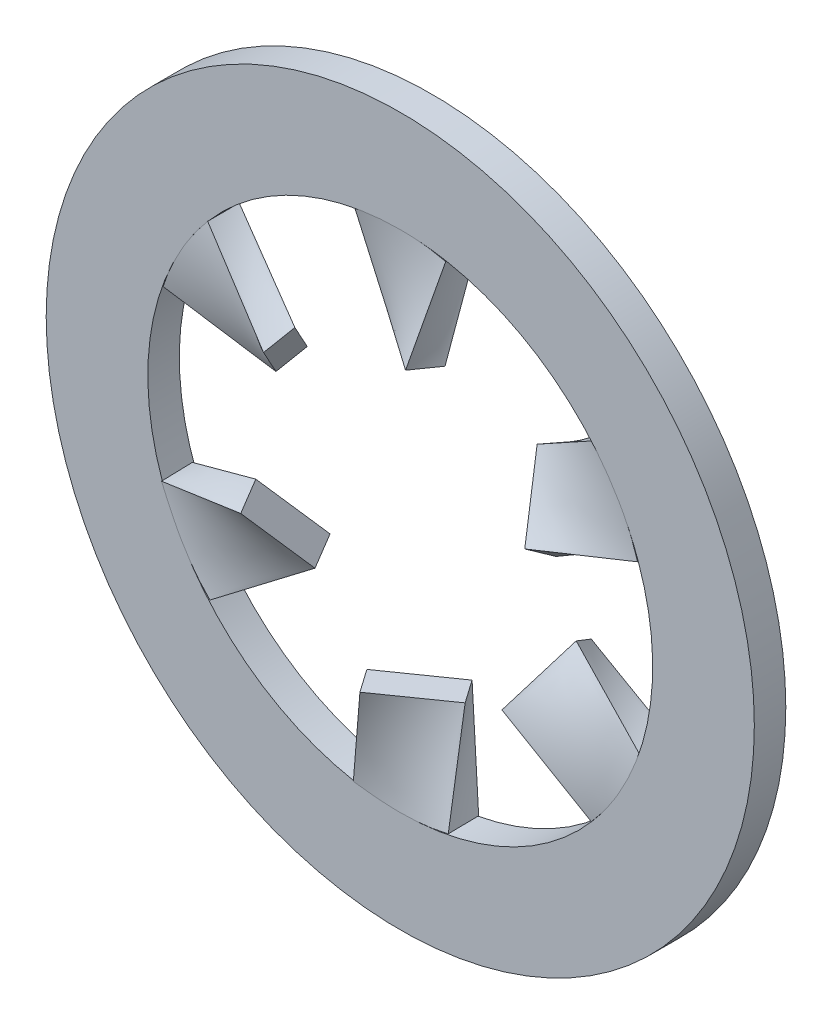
from build123d import *

# Parameters (mm, degrees)
CIRPATTERN1_COUNT       = 6
CUT_EXTRUDE1_DEPTH      = 4.40344423
CUT_EXTRUDE1_DEPTH_BACK = 4.40344423
SKETCH4_OUTSIDE_W       = 8.054
SKETCH4_OUTSIDE_H       = 8.252
SKETCH4_OUTSIDE_R       = 2.44475
SKETCH5_R               = 3.429
SKETCH5_R_2             = 2.44475
EXTRUDE1_DEPTH          = 0.1524


with BuildPart() as part:
    # Sketch2 → Loft1 section 0
    with BuildSketch(Plane(origin=(0, 2.44475, 0), x_dir=(-1, 0, 0), z_dir=(0, 1, 0))):
        with BuildLine():
            Line((-0.4572, 0.1524), (0.4572, 0.1524))
            Line((0.4572, 0.1524), (0.4572, -0.1524))
            Line((0.4572, -0.1524), (-0.4572, -0.1524))
            Line((-0.4572, -0.1524), (-0.4572, 0.1524))
        make_face()
    # Sketch3 → Loft1 section 1
    with BuildSketch(Plane(origin=(0, 1.4605, 0), x_dir=(-1, 0, 0), z_dir=(0, 1, 0))):
        with BuildLine():
            Line((-0.220941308, 0.322146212), (-0.378284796, 0.097436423))
            Line((-0.378284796, 0.097436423), (0.220941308, -0.322146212))
            Line((0.220941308, -0.322146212), (0.378284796, -0.097436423))
            Line((0.378284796, -0.097436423), (-0.220941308, 0.322146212))
        make_face()
    loft()


with BuildPart() as cirpattern1_1:
    # CirPattern1: pattern copy
    add(part.part.rotate(Axis((0, 0, -0.647036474), (0, 0, 1)), 1 * 360 / CIRPATTERN1_COUNT))


with BuildPart() as cirpattern1_2:
    # CirPattern1: pattern copy
    add(part.part.rotate(Axis((0, 0, -0.647036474), (0, 0, 1)), 2 * 360 / CIRPATTERN1_COUNT))


with BuildPart() as cirpattern1_3:
    # CirPattern1: pattern copy
    add(part.part.rotate(Axis((0, 0, -0.647036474), (0, 0, 1)), 3 * 360 / CIRPATTERN1_COUNT))


with BuildPart() as cirpattern1_4:
    # CirPattern1: pattern copy
    add(part.part.rotate(Axis((0, 0, -0.647036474), (0, 0, 1)), 4 * 360 / CIRPATTERN1_COUNT))


with BuildPart() as cirpattern1_5:
    # CirPattern1: pattern copy
    add(part.part.rotate(Axis((0, 0, -0.647036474), (0, 0, 1)), 5 * 360 / CIRPATTERN1_COUNT))


with BuildPart() as cut_extrude1_tool:
    # Sketch4 outside → Cut-Extrude1 (new, two sides: drawn at the far end of the back side and taken through both)
    with BuildSketch(Plane.XY.offset(-CUT_EXTRUDE1_DEPTH_BACK)):
        Rectangle(SKETCH4_OUTSIDE_W, SKETCH4_OUTSIDE_H)
        Circle(SKETCH4_OUTSIDE_R, mode=Mode.SUBTRACT)
    extrude(amount=CUT_EXTRUDE1_DEPTH + CUT_EXTRUDE1_DEPTH_BACK)


with BuildPart() as part_1:
    add(part.part)

    # Cut-Extrude1: cut by cut_extrude1_tool
    add(cut_extrude1_tool.part, mode=Mode.SUBTRACT)



with BuildPart() as cirpattern1_1_1:
    add(cirpattern1_1.part)

    # Cut-Extrude1: cut by cut_extrude1_tool
    add(cut_extrude1_tool.part, mode=Mode.SUBTRACT)


with BuildPart() as cirpattern1_2_1:
    add(cirpattern1_2.part)

    # Cut-Extrude1: cut by cut_extrude1_tool
    add(cut_extrude1_tool.part, mode=Mode.SUBTRACT)


with BuildPart() as cirpattern1_3_1:
    add(cirpattern1_3.part)

    # Cut-Extrude1: cut by cut_extrude1_tool
    add(cut_extrude1_tool.part, mode=Mode.SUBTRACT)


with BuildPart() as cirpattern1_4_1:
    add(cirpattern1_4.part)

    # Cut-Extrude1: cut by cut_extrude1_tool
    add(cut_extrude1_tool.part, mode=Mode.SUBTRACT)


with BuildPart() as cirpattern1_5_1:
    add(cirpattern1_5.part)

    # Cut-Extrude1: cut by cut_extrude1_tool
    add(cut_extrude1_tool.part, mode=Mode.SUBTRACT)


with BuildPart() as part_2:
    add(part_1.part)

    add(cirpattern1_1_1.part)  # Extrude1 merges CirPattern1_1

    add(cirpattern1_2_1.part)  # Extrude1 merges CirPattern1_2

    add(cirpattern1_3_1.part)  # Extrude1 merges CirPattern1_3

    add(cirpattern1_4_1.part)  # Extrude1 merges CirPattern1_4

    add(cirpattern1_5_1.part)  # Extrude1 merges CirPattern1_5
    # Sketch5 → Extrude1 (add, symmetric)
    with BuildSketch(Plane.XY):
        Circle(SKETCH5_R)
        Circle(SKETCH5_R_2, mode=Mode.SUBTRACT)
    extrude(amount=EXTRUDE1_DEPTH, both=True)


solid = part_2.part
